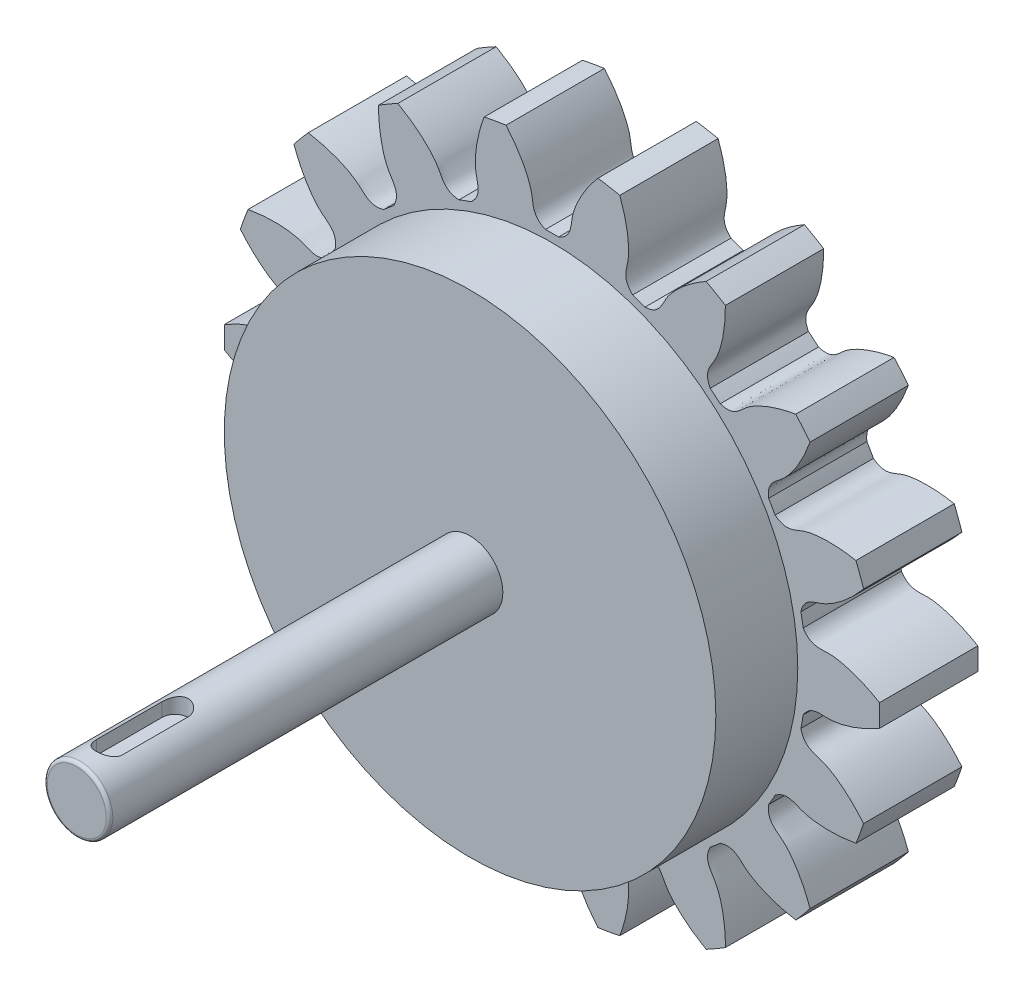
from build123d import *

# Parameters (mm, degrees)
SKETCH_1_R               = 20
EXTRUDE_1_DEPTH          = 6
CUT_EXTRUDE_1_DEPTH      = 29.91366459
PATTERN_CIRCULAR_1_COUNT = 18
SKETCH_4_R               = 2
EXTRUDE_2_DEPTH          = 29
FILLET_1_R               = 0.2
CUT_EXTRUDE_START        = 1
CUT_EXTRUDE_2_DEPTH      = 38
SKETCH_7_R               = 15
SKETCH_7_R_2             = 2
EXTRUDE_3_DEPTH          = 5


with BuildPart() as part:
    # Sketch 1 → Extrude 1 (new body)
    with BuildSketch(Plane.XY):
        Circle(SKETCH_1_R)
    extrude(amount=EXTRUDE_1_DEPTH)

    # Sketch 2 → Cut-Extrude 1 (cut, through all)
    with BuildSketch(Plane.XY):
        with BuildLine():
            ThreePointArc((0.398807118, 15.494868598), (0, 15.5), (-0.398807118, 15.494868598))
            add(Edge.make_bspline(
                [(-0.398807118, 15.494868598), (-1.23020808, 15.837360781), (-1.1255781, 16.477399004), (-1.263665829, 17.085190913), (-1.27750304, 17.141013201), (-1.294215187, 17.203080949), (-1.314049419, 17.271300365), (-1.337260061, 17.345568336), (-1.364095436, 17.425774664), (-1.394801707, 17.511801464), (-1.429621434, 17.603523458), (-1.46879375, 17.700807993), (-1.512554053, 17.803515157), (-1.561133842, 17.911497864), (-1.614760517, 18.02460196), (-1.673657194, 18.142666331), (-1.738042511, 18.265523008), (-1.80813045, 18.392997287), (-1.884130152, 18.524907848), (-1.96624574, 18.661066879), (-2.054676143, 18.801280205), (-2.149614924, 18.945347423), (-2.25125011, 19.09306204), (-2.359764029, 19.244211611), (-2.475333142, 19.398577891), (-2.598127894, 19.555936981), (-2.728312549, 19.716059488), (-2.866045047, 19.878710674), (-3.011476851, 20.043650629), (-3.164752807, 20.210634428), (-3.326011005, 20.379412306), (-3.495382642, 20.549729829), (-3.672991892, 20.72132807), (-3.858955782, 20.893943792), (-4.053384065, 21.067309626), (-4.256379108, 21.241154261), (-4.468035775, 21.415202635), (-4.68844132, 21.58917612), (-4.917675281, 21.762792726), (-5.155809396, 21.935767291), (-5.402907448, 22.107811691), (-5.748150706, 22.338079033), (-6.015110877, 22.504667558), (-6.197121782, 22.613356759)],
                knots=[0, 0, 0, 0, 0.187591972, 0.192996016, 0.1991206, 0.205965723, 0.213531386, 0.221817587, 0.230824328, 0.240551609, 0.250999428, 0.262167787, 0.274056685, 0.286666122, 0.299996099, 0.314046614, 0.32881767, 0.344309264, 0.360521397, 0.37745407, 0.395107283, 0.413481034, 0.432575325, 0.452390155, 0.472925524, 0.494181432, 0.51615788, 0.538854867, 0.562272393, 0.586410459, 0.611269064, 0.636848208, 0.663147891, 0.690168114, 0.717908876, 0.746370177, 0.775552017, 0.805454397, 0.836077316, 0.867420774, 0.899484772, 0.932269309, 1, 1, 1, 1], degree=3))
            ThreePointArc((-6.197121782, 22.613356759), (0, 23.447136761), (6.197121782, 22.613356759))
            add(Edge.make_bspline(
                [(0.398807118, 15.494868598), (1.23020808, 15.837360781), (1.1255781, 16.477399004), (1.263665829, 17.085190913), (1.27750304, 17.141013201), (1.294215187, 17.203080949), (1.314049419, 17.271300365), (1.337260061, 17.345568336), (1.364095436, 17.425774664), (1.394801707, 17.511801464), (1.429621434, 17.603523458), (1.46879375, 17.700807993), (1.512554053, 17.803515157), (1.561133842, 17.911497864), (1.614760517, 18.02460196), (1.673657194, 18.142666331), (1.738042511, 18.265523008), (1.80813045, 18.392997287), (1.884130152, 18.524907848), (1.96624574, 18.661066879), (2.054676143, 18.801280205), (2.149614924, 18.945347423), (2.25125011, 19.09306204), (2.359764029, 19.244211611), (2.475333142, 19.398577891), (2.598127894, 19.555936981), (2.728312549, 19.716059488), (2.866045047, 19.878710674), (3.011476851, 20.043650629), (3.164752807, 20.210634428), (3.326011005, 20.379412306), (3.495382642, 20.549729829), (3.672991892, 20.72132807), (3.858955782, 20.893943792), (4.053384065, 21.067309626), (4.256379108, 21.241154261), (4.468035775, 21.415202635), (4.68844132, 21.58917612), (4.917675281, 21.762792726), (5.155809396, 21.935767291), (5.402907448, 22.107811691), (5.748150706, 22.338079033), (6.015110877, 22.504667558), (6.197121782, 22.613356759)],
                knots=[0, 0, 0, 0, 0.187591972, 0.192996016, 0.1991206, 0.205965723, 0.213531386, 0.221817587, 0.230824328, 0.240551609, 0.250999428, 0.262167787, 0.274056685, 0.286666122, 0.299996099, 0.314046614, 0.32881767, 0.344309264, 0.360521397, 0.37745407, 0.395107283, 0.413481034, 0.432575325, 0.452390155, 0.472925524, 0.494181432, 0.51615788, 0.538854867, 0.562272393, 0.586410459, 0.611269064, 0.636848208, 0.663147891, 0.690168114, 0.717908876, 0.746370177, 0.775552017, 0.805454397, 0.836077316, 0.867420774, 0.899484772, 0.932269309, 1, 1, 1, 1], degree=3))
        make_face()
    cut_extrude_1 = extrude(amount=CUT_EXTRUDE_1_DEPTH, mode=Mode.SUBTRACT)

    # Pattern Circular 1: Cut-Extrude 1 ×18 about axis
    pattern_circular_1_axis = Axis((0, 0, 6), (0, 0, -1))
    for i in range(1, PATTERN_CIRCULAR_1_COUNT):
        add(cut_extrude_1.rotate(pattern_circular_1_axis, i * 360 / PATTERN_CIRCULAR_1_COUNT), mode=Mode.SUBTRACT)

    # Sketch 4 → Extrude 2 (add)
    with BuildSketch(Plane.XY.offset(6)):
        with Locations(Location((0, 0, 0), (0, 0, 180))):
            Circle(SKETCH_4_R)
    extrude(amount=EXTRUDE_2_DEPTH)

    # Fillet 1
    fillet_1_edges = [part.edges().sort_by_distance(p)[0] for p in [
        (2, 0, 35),
    ]]
    fillet(fillet_1_edges, radius=FILLET_1_R)

    # Sketch 5 → Cut-Extrude 2 (cut)
    with BuildSketch(Plane(origin=(0, 0, 0), x_dir=(1, 0, 0), z_dir=(0, 1, 0)).offset(CUT_EXTRUDE_START)):
        with BuildLine():
            Line((-0.8, -33), (-0.8, -29))
            ThreePointArc((-0.8, -29), (0, -28.2), (0.8, -29))
            Line((0.8, -29), (0.8, -33))
            ThreePointArc((0.8, -33), (0, -33.8), (-0.8, -33))
        make_face()
    extrude(amount=CUT_EXTRUDE_2_DEPTH, mode=Mode.SUBTRACT)

    # Sketch 7 → Extrude 3 (add)
    with BuildSketch(Plane.XY.offset(6)):
        Circle(SKETCH_7_R)
        Circle(SKETCH_7_R_2, mode=Mode.SUBTRACT)
    extrude(amount=EXTRUDE_3_DEPTH)


solid = part.part
